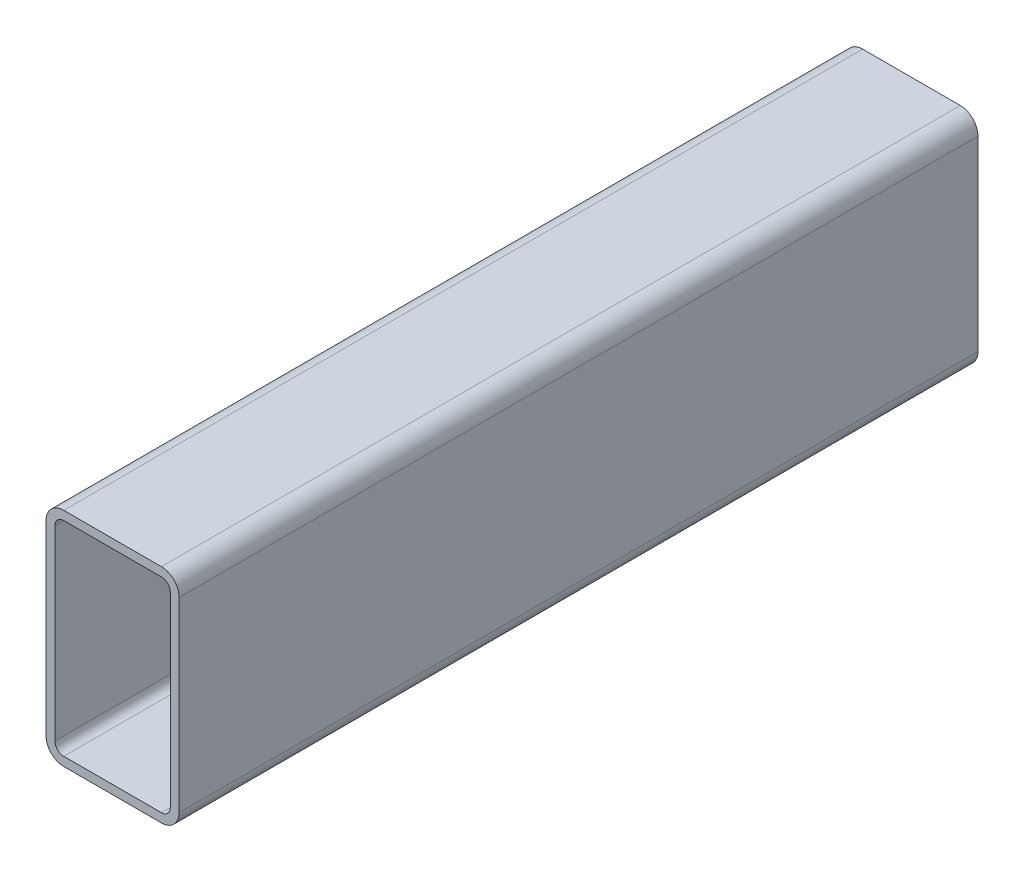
from build123d import *

# Parameters (mm, degrees)
EXTRUSION1_DEPTH = 450


with BuildPart() as part:
    # Esquisse1 → Extrusion1 (new, symmetric)
    with BuildSketch(Plane.XY):
        with BuildLine():
            Line((20, 0), (130, 0))
            ThreePointArc((130, 0), (144.142135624, 5.857864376), (150, 20))
            Line((150, 20), (150, 230))
            ThreePointArc((150, 230), (144.142135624, 244.142135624), (130, 250))
            Line((130, 250), (20, 250))
            ThreePointArc((20, 250), (5.857864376, 244.142135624), (0, 230))
            Line((0, 230), (0, 20))
            ThreePointArc((0, 20), (5.857864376, 5.857864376), (20, 0))
        make_face()
        with BuildLine():
            Line((130, 240), (20, 240))
            ThreePointArc((20, 240), (12.928932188, 237.071067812), (10, 230))
            Line((10, 230), (10, 20))
            ThreePointArc((10, 20), (12.928932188, 12.928932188), (20, 10))
            Line((20, 10), (130, 10))
            ThreePointArc((130, 10), (137.071067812, 12.928932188), (140, 20))
            Line((140, 20), (140, 230))
            ThreePointArc((140, 230), (137.071067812, 237.071067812), (130, 240))
        make_face(mode=Mode.SUBTRACT)
    extrude(amount=EXTRUSION1_DEPTH, both=True)


solid = part.part
